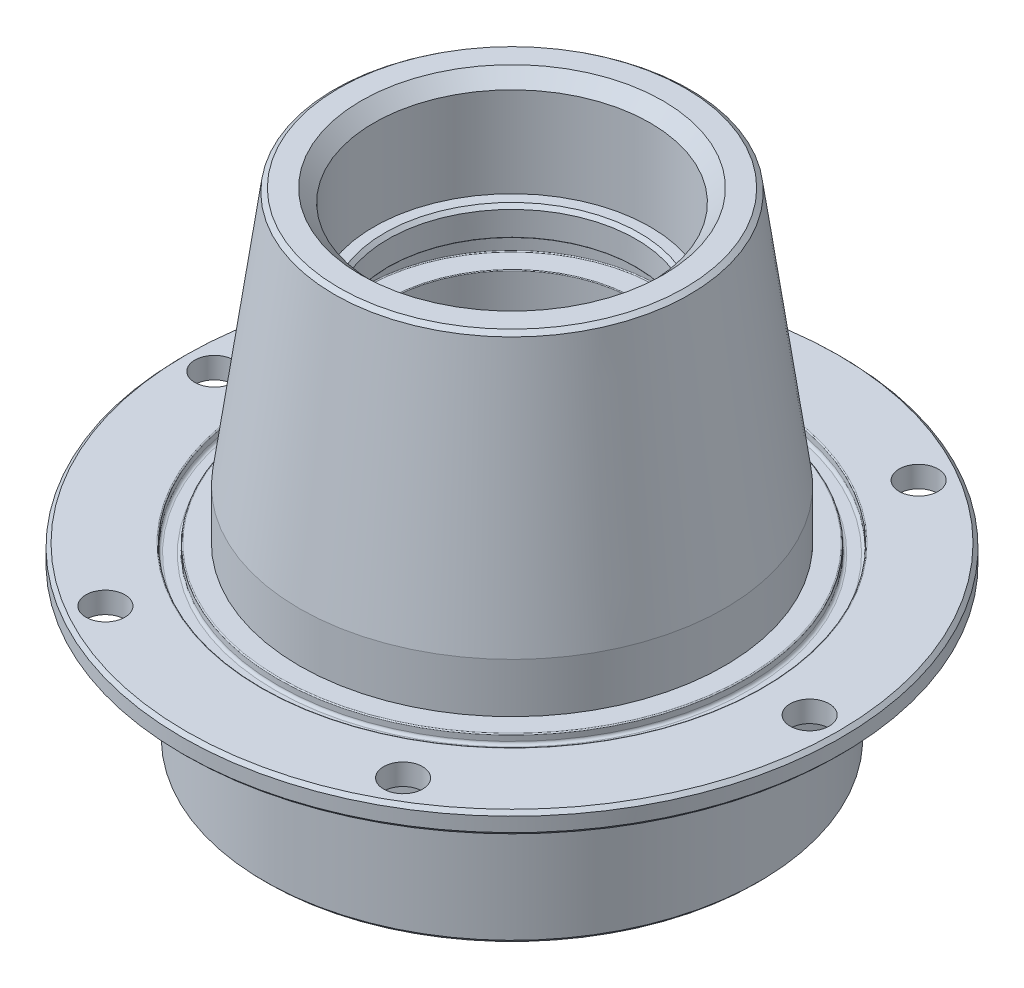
from build123d import *
from OCP.BRepFilletAPI import BRepFilletAPI_MakeChamfer

# Parameters (mm, degrees)
CHANFREIN1_SIZE              = 1.8
CHANFREIN2_SIZE              = 0.5
CHANFREIN2_SIZE2             = 0.585042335
CONG_1_R                     = 1
CONG_2_R                     = 0.15
CONG_3_R                     = 0.4
CONG_4_R                     = 0.1
CONG_5_R                     = 0.13
ESQUISSE3_R                  = 2.75
PER_AGE_DEPTH                = 3
R_P_TITION_CIRCULAIRE1_COUNT = 6


with BuildPart() as part:
    # Esquisse1 → R_volution1 (revolve)
    with BuildSketch(Plane.XY, mode=Mode.PRIVATE) as r_volution1_sk:
        Polygon((-19.5, 0), (-25, 0), (-30, -36.406372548), (-30, -43.406372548), (-33, -43.406372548), (-33, -44.706372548), (-35.28, -44.706372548), (-35.28, -43.406372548), (-46.5, -43.406372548), (-46.5, -46.406372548), (-35, -46.406372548), (-35, -67.7), (-31, -67.7), (-31, -63.2), (-32.5, -63.2), (-32.5, -61), (-31, -61), (-31, -47), (-27, -47), (-27, -46.5), (-17.5, -46.5), (-17.5, -42.9), (-20.72, -42.9), (-20.72, -39), (-17.5, -39), (-17.5, -22.4), (-20.72, -22.4), (-20.72, -18.5), (-17.5, -18.5), (-17.5, -14.5), (-19.5, -14.5), align=None)
    revolve(r_volution1_sk.sketch.rotate(Axis((0, 58.111721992, 0), (0, -1, 0)), 270), axis=Axis((0, 58.111721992, 0), (0, -1, 0)))

    # Chanfrein1
    chanfrein1_edges = [part.edges().sort_by_distance(p)[0] for p in [
        (0, 0, -19.5),
    ]]
    chamfer(chanfrein1_edges, length=CHANFREIN1_SIZE)

    # Chanfrein2: one chamfer whose edges measure the first distance from different faces: ONE call of the kernel's chamfer builder (chamfer() names one face for all edges)
    chanfrein2_edges_1 = [part.edges().sort_by_distance(p)[0] for p in [
        (0, 0, -25),
    ]]
    chanfrein2_side_1 = [part.faces().sort_by_distance(p)[0] for p in [
        (0, -18.203186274, -27.5),
    ]]
    chanfrein2_edges_2 = [part.edges().sort_by_distance(p)[0] for p in [
        (0, -14.5, -17.5),
        (0, -46.5, -17.5),
        (0, -67.7, -31),
        (0, -67.7, -35),
        (0, -46.406372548, -46.5),
        (0, -43.406372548, -46.5),
    ]]
    chanfrein2 = BRepFilletAPI_MakeChamfer(part.part.solid().wrapped)
    for e in chanfrein2_edges_1:
        chanfrein2.Add(CHANFREIN2_SIZE, CHANFREIN2_SIZE2, e.wrapped, chanfrein2_side_1[0].wrapped)  # the first distance lies on this face
    for e in chanfrein2_edges_2:
        chanfrein2.Add(CHANFREIN2_SIZE, e.wrapped)
    add(Compound.cast(chanfrein2.Shape()), mode=Mode.REPLACE)

    # Cong_1
    cong_1_edges = [part.edges().sort_by_distance(p)[0] for p in [
        (0, -46.406372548, -35),
    ]]
    fillet(cong_1_edges, radius=CONG_1_R)

    # Cong_2
    cong_2_edges = [part.edges().sort_by_distance(p)[0] for p in [
        (0, -43.406372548, -35.28),
        (0, -43.406372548, -33),
    ]]
    fillet(cong_2_edges, radius=CONG_2_R)

    # Cong_3
    cong_3_edges = [part.edges().sort_by_distance(p)[0] for p in [
        (0, -44.706372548, -35.28),
        (0, -44.706372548, -33),
    ]]
    fillet(cong_3_edges, radius=CONG_3_R)

    # Cong_4
    cong_4_edges = [part.edges().sort_by_distance(p)[0] for p in [
        (0, -18.5, -17.5),
        (0, -22.4, -17.5),
        (0, -39, -17.5),
        (0, -42.9, -17.5),
    ]]
    fillet(cong_4_edges, radius=CONG_4_R)

    # Cong_5
    cong_5_edges = [part.edges().sort_by_distance(p)[0] for p in [
        (0, -18.5, -20.72),
        (0, -22.4, -20.72),
        (0, -39, -20.72),
        (0, -42.9, -20.72),
    ]]
    fillet(cong_5_edges, radius=CONG_5_R)

    # Esquisse3 → Per_age (cut)
    with BuildSketch(Plane(origin=(0, -43.406372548, 0), x_dir=(1, 0, 0), z_dir=(0, 1, 0))):
        with Locations(Location((-42, 0, 0), (0, 0, 270))):
            Circle(ESQUISSE3_R)
    per_age = extrude(amount=-PER_AGE_DEPTH, mode=Mode.SUBTRACT)

    # R_p_tition circulaire1: Per_age ×6 about axis
    r_p_tition_circulaire1_axis = Axis((0, 0, 0), (0, 1, 0))
    for i in range(1, R_P_TITION_CIRCULAIRE1_COUNT):
        add(per_age.rotate(r_p_tition_circulaire1_axis, i * 360 / R_P_TITION_CIRCULAIRE1_COUNT), mode=Mode.SUBTRACT)


solid = part.part
